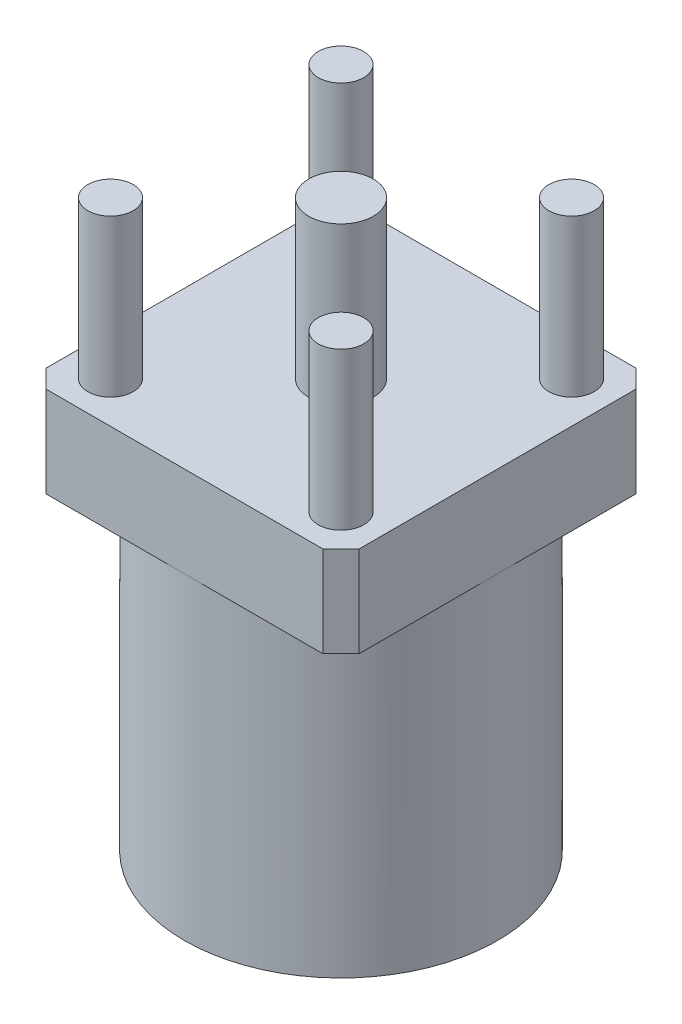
from build123d import *

# Parameters (mm, degrees)
BOSS_EXTRUDE1_DEPTH = 1
SKETCH4_R           = 1.725
SKETCH4_R_2         = 1.375
SKETCH4_R_3         = 0.35
BOSS_EXTRUDE2_DEPTH = 3.5
SKETCH5_R           = 0.25
SKETCH5_R_2         = 0.3556
BOSS_EXTRUDE3_DEPTH = 1.7272
CUT_EXTRUDE1_START  = -1.016
SKETCH6_R           = 0.35
CUT_EXTRUDE1_DEPTH  = 1.016


with BuildPart() as part:
    # Sketch3 → Boss-Extrude1 (new body)
    with BuildSketch(Plane(origin=(0, 0, 0), x_dir=(1, 0, 0), z_dir=(0, 1, 0))):
        Polygon((-1.725, -1.525), (-1.525, -1.725), (1.525, -1.725), (1.725, -1.525), (1.725, 1.525), (1.525, 1.725), (-1.525, 1.725), (-1.725, 1.525), align=None)
    extrude(amount=BOSS_EXTRUDE1_DEPTH)

    # Sketch4 → Boss-Extrude2 (add)
    # profile 1 of 2: a face of its own
    with BuildSketch(Plane.XZ):
        with Locations(Location((0, 0, 0), (0, 0, 270))):
            Circle(SKETCH4_R)
        with Locations(Location((0, 0, 0), (0, 0, 270))):
            Circle(SKETCH4_R_2, mode=Mode.SUBTRACT)
    # profile 2 of 2: a face of its own
    with BuildSketch(Plane.XZ):
        with Locations(Location((0, 0, 0), (0, 0, 90))):
            Circle(SKETCH4_R_3)
    extrude(amount=BOSS_EXTRUDE2_DEPTH)

    # Sketch5 → Boss-Extrude3 (add)
    with BuildSketch(Plane(origin=(0, 1, 0), x_dir=(1, 0, 0), z_dir=(0, 1, 0))):
        with Locations(Location((-1.27, 1.27, 0), (0, 0, 270))):
            Circle(SKETCH5_R)
        with Locations(Location((-1.27, -1.27, 0), (0, 0, 270))):
            Circle(SKETCH5_R)
        with Locations(Location((1.27, 1.27, 0), (0, 0, 270))):
            Circle(SKETCH5_R)
        with Locations(Location((1.27, -1.27, 0), (0, 0, 270))):
            Circle(SKETCH5_R)
        with Locations(Location((0, 0, 0), (0, 0, 270))):
            Circle(SKETCH5_R_2)
    extrude(amount=BOSS_EXTRUDE3_DEPTH)

    # Sketch6 → Cut-Extrude1 (cut)
    with BuildSketch(Plane.XZ.offset(3.5).offset(CUT_EXTRUDE1_START)):
        with Locations(Location((0, 0, 0), (0, 0, 90))):
            Circle(SKETCH6_R)
    extrude(amount=CUT_EXTRUDE1_DEPTH, mode=Mode.SUBTRACT)


solid = part.part
